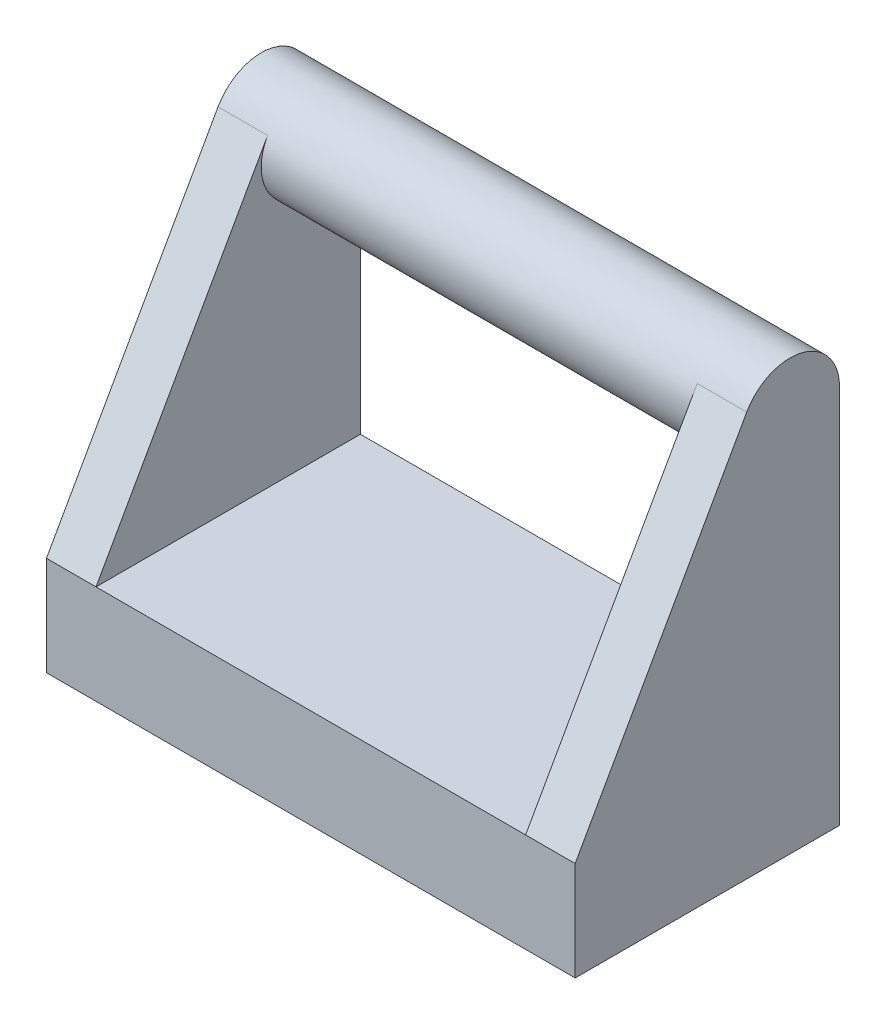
from build123d import *

# Parameters (mm, degrees)
ESQUISSE2_W                = 16
ESQUISSE2_H                = 8
EXTRUSION1_DEPTH           = 1
ESQUISSE3_R                = 1.5
ESQUISSE3_R_2              = 1
EXTRUSION2_DEPTH           = 2
ESQUISSE4_W                = 16
ESQUISSE4_H                = 8
ESQUISSE4_W_2              = 14
ESQUISSE4_H_2              = 6
EXTRUSION3_DEPTH           = 2
EXTRUSION7_DEPTH           = 1.5
ESQUISSE8_R                = 1.5
EXTRUSION8_DEPTH           = 16
R_P_TITION_LIN_AIRE1_COUNT = 2
R_P_TITION_LIN_AIRE1_PITCH = 14.5


with BuildPart() as part:
    # Esquisse2 → Extrusion1 (new body)
    with BuildSketch(Plane(origin=(0, 0, 0), x_dir=(1, 0, 0), z_dir=(0, 1, 0))):
        with Locations((8, -4)):
            Rectangle(ESQUISSE2_W, ESQUISSE2_H)
    extrude(amount=-EXTRUSION1_DEPTH)

    # Esquisse3 → Extrusion2 (add)
    with BuildSketch(Plane.XZ.offset(1)):
        with Locations(Location((8, 4, 0), (0, 0, 90))):
            Circle(ESQUISSE3_R)
        with Locations(Location((8, 4, 0), (0, 0, 270))):
            Circle(ESQUISSE3_R_2, mode=Mode.SUBTRACT)
    extrude(amount=EXTRUSION2_DEPTH)

    # Esquisse4 → Extrusion3 (add)
    with BuildSketch(Plane.XZ.offset(1)):
        with Locations((8, 4)):
            Rectangle(ESQUISSE4_W, ESQUISSE4_H)
        with Locations((8, 4)):
            Rectangle(ESQUISSE4_W_2, ESQUISSE4_H_2, mode=Mode.SUBTRACT)
    extrude(amount=EXTRUSION3_DEPTH)

    # Esquisse7 → Extrusion7 (add)
    with BuildSketch(Plane(origin=(16, 0, 0), x_dir=(0, 0, -1), z_dir=(1, 0, 0))):
        with BuildLine():
            Line((0, 0), (0, 8.5))
            ThreePointArc((0, 8.5), (-1.12003357, 9.951077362), (-2.807500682, 9.235147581))
            Line((-2.807500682, 9.235147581), (-8, 0))
            Line((-8, 0), (0, 0))
        make_face()
    extrusion7 = extrude(amount=-EXTRUSION7_DEPTH)

    # Esquisse8 → Extrusion8 (add)
    with BuildSketch(Plane(origin=(16, 0, 0), x_dir=(0, 0, -1), z_dir=(1, 0, 0))):
        with Locations((-1.5, 8.5)):
            Circle(ESQUISSE8_R)
    extrude(amount=-EXTRUSION8_DEPTH)

    # R_p_tition lin_aire1: Extrusion7 ×2
    with Locations(*[(-i * R_P_TITION_LIN_AIRE1_PITCH, 0, 0) for i in range(1, R_P_TITION_LIN_AIRE1_COUNT)]):
        add(extrusion7)


solid = part.part
